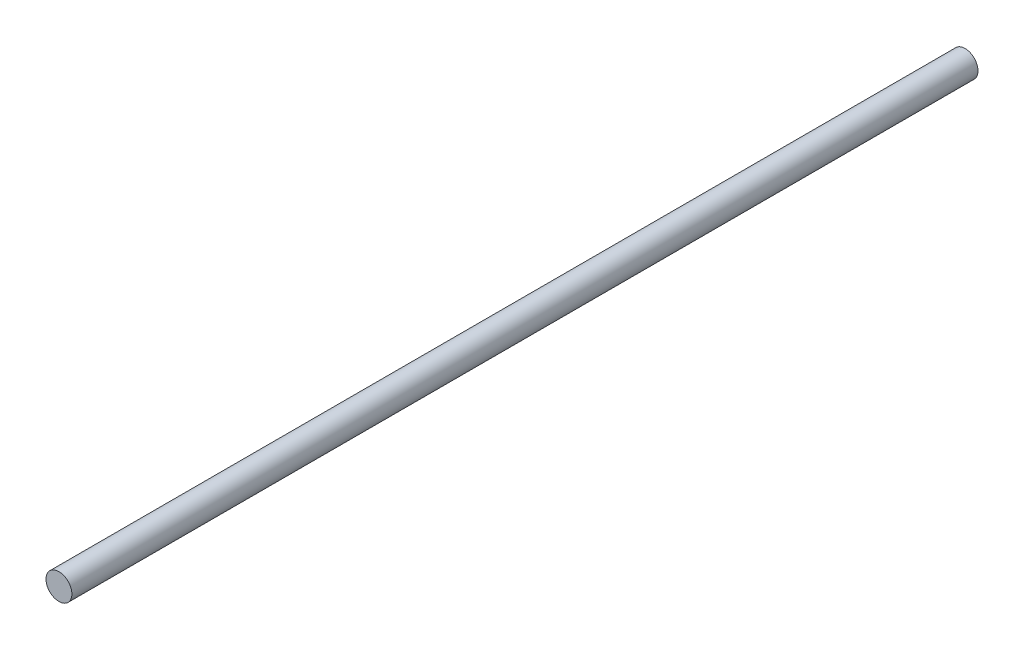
ISO-10303-21;
HEADER;
FILE_DESCRIPTION(('STEP AP214'),'2;1');
FILE_NAME('part.step','',(''),(''),'','','');
FILE_SCHEMA(('AUTOMOTIVE_DESIGN { 1 0 10303 214 1 1 1 1 }'));
ENDSEC;
DATA;
#1=APPLICATION_CONTEXT('core data for automotive mechanical design processes');
#2=APPLICATION_PROTOCOL_DEFINITION('international standard','automotive_design',2000,#1);
#3=PRODUCT_CONTEXT('',#1,'mechanical');
#4=PRODUCT('Part','Part','',(#3));
#5=PRODUCT_RELATED_PRODUCT_CATEGORY('part','',(#4));
#6=PRODUCT_DEFINITION_FORMATION('','',#4);
#7=PRODUCT_DEFINITION_CONTEXT('part definition',#1,'design');
#8=PRODUCT_DEFINITION('design','',#6,#7);
#9=PRODUCT_DEFINITION_SHAPE('','',#8);
#10=(LENGTH_UNIT() NAMED_UNIT(*) SI_UNIT(.MILLI.,.METRE.));
#11=(NAMED_UNIT(*) PLANE_ANGLE_UNIT() SI_UNIT($,.RADIAN.));
#12=(NAMED_UNIT(*) SI_UNIT($,.STERADIAN.) SOLID_ANGLE_UNIT());
#13=UNCERTAINTY_MEASURE_WITH_UNIT(LENGTH_MEASURE(1.E-05),#10,'distance_accuracy_value','');
#14=(GEOMETRIC_REPRESENTATION_CONTEXT(3) GLOBAL_UNCERTAINTY_ASSIGNED_CONTEXT((#13)) GLOBAL_UNIT_ASSIGNED_CONTEXT((#10,
#11,#12)) REPRESENTATION_CONTEXT('',''));
#15=CARTESIAN_POINT('',(0.,0.,0.));
#16=DIRECTION('',(0.,0.,1.));
#17=DIRECTION('',(1.,0.,0.));
#18=AXIS2_PLACEMENT_3D('',#15,#16,#17);
#19=CARTESIAN_POINT('',(0.,0.,-2100.));
#20=DIRECTION('',(0.,0.,1.));
#21=DIRECTION('',(1.,0.,0.));
#22=AXIS2_PLACEMENT_3D('',#19,#20,#21);
#23=CYLINDRICAL_SURFACE('',#22,30.);
#24=CARTESIAN_POINT('',(0.,0.,-2100.));
#25=DIRECTION('',(0.,0.,1.));
#26=DIRECTION('',(1.,0.,0.));
#27=AXIS2_PLACEMENT_3D('',#24,#25,#26);
#28=CIRCLE('',#27,30.);
#29=CARTESIAN_POINT('',(30.,0.,-2100.));
#30=VERTEX_POINT('',#29);
#31=EDGE_CURVE('E10',#30,#30,#28,.T.);
#32=ORIENTED_EDGE('',*,*,#31,.T.);
#33=EDGE_LOOP('',(#32));
#34=FACE_BOUND('',#33,.T.);
#35=CARTESIAN_POINT('',(0.,0.,0.));
#36=DIRECTION('',(0.,0.,1.));
#37=DIRECTION('',(1.,0.,0.));
#38=AXIS2_PLACEMENT_3D('',#35,#36,#37);
#39=CIRCLE('',#38,30.);
#40=CARTESIAN_POINT('',(30.,0.,0.));
#41=VERTEX_POINT('',#40);
#42=EDGE_CURVE('E40',#41,#41,#39,.T.);
#43=ORIENTED_EDGE('',*,*,#42,.F.);
#44=EDGE_LOOP('',(#43));
#45=FACE_BOUND('',#44,.T.);
#46=ADVANCED_FACE('F37',(#34,#45),#23,.T.);
#47=CARTESIAN_POINT('',(0.,0.,-2100.));
#48=DIRECTION('',(0.,0.,1.));
#49=DIRECTION('',(1.,0.,0.));
#50=AXIS2_PLACEMENT_3D('',#47,#48,#49);
#51=PLANE('',#50);
#52=ORIENTED_EDGE('',*,*,#31,.F.);
#53=EDGE_LOOP('',(#52));
#54=FACE_BOUND('',#53,.T.);
#55=ADVANCED_FACE('F54',(#54),#51,.F.);
#56=CARTESIAN_POINT('',(0.,0.,0.));
#57=DIRECTION('',(0.,0.,1.));
#58=DIRECTION('',(1.,0.,0.));
#59=AXIS2_PLACEMENT_3D('',#56,#57,#58);
#60=PLANE('',#59);
#61=ORIENTED_EDGE('',*,*,#42,.T.);
#62=EDGE_LOOP('',(#61));
#63=FACE_BOUND('',#62,.T.);
#64=ADVANCED_FACE('F51',(#63),#60,.T.);
#65=CLOSED_SHELL('',(#46,#55,#64));
#66=MANIFOLD_SOLID_BREP('B2',#65);
#67=ADVANCED_BREP_SHAPE_REPRESENTATION('',(#18,#66),#14);
#68=SHAPE_DEFINITION_REPRESENTATION(#9,#67);
ENDSEC;
END-ISO-10303-21;
